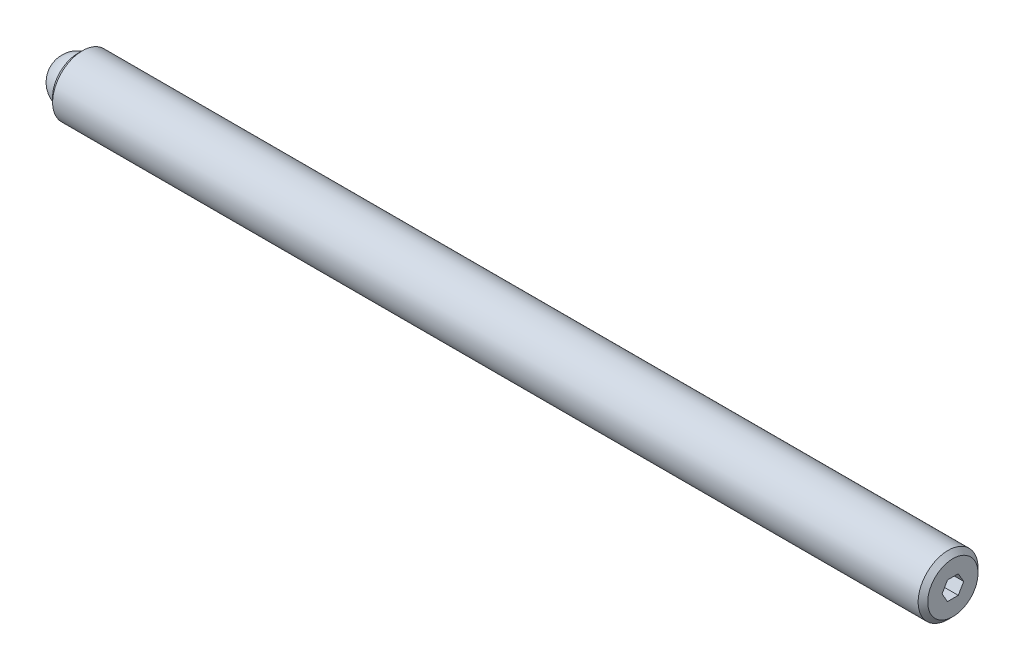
from build123d import *

# Parameters (mm, degrees)
SKETCH2_R           = 3.175
BOSS_EXTRUDE1_DEPTH = 92.86875
CHAMFER1_SIZE       = 0.508
CHAMFER2_SIZE       = 0.508
CUT_EXTRUDE2_DEPTH  = 2.286
SKETCH3_R           = 2.38125
CUT_EXTRUDE3_DEPTH  = 1.984375


with BuildPart() as part:
    # Sketch2 → Boss-Extrude1 (new body)
    with BuildSketch(Plane(origin=(0, 0, 0), x_dir=(0, 0, -1), z_dir=(1, 0, 0))):
        Circle(SKETCH2_R)
    extrude(amount=BOSS_EXTRUDE1_DEPTH)

    # Chamfer1
    chamfer1_edges = [part.edges().sort_by_distance(p)[0] for p in [
        (0, 0, 3.175),
    ]]
    chamfer(chamfer1_edges, length=CHAMFER1_SIZE)

    # Chamfer2
    chamfer2_edges = [part.edges().sort_by_distance(p)[0] for p in [
        (92.86875, 0, 3.175),
    ]]
    chamfer(chamfer2_edges, length=CHAMFER2_SIZE)

    # Sketch4 → Cut-Extrude2 (cut)
    with BuildSketch(Plane(origin=(92.86875, 0, 0), x_dir=(0, 0, -1), z_dir=(1, 0, 0))):
        Polygon((1.14567944, 0), (0.57283972, 0.9921875), (-0.57283972, 0.9921875), (-1.14567944, 0), (-0.57283972, -0.9921875), (0.57283972, -0.9921875), align=None)
    extrude(amount=-CUT_EXTRUDE2_DEPTH, mode=Mode.SUBTRACT)

    # Sketch3 → Cut-Extrude3 (cut)
    with BuildSketch(Plane.ZY):
        Circle(SKETCH3_R)
    extrude(amount=-CUT_EXTRUDE3_DEPTH, mode=Mode.SUBTRACT)


with BuildPart() as body_2:
    # Sketch5 → Revolve1 (revolve)
    with BuildSketch(Plane.ZY):
        with BuildLine():
            Line((0, 0), (0, -2.38125))
            ThreePointArc((0, -2.38125), (-2.38125, 0), (0, 2.38125))
            Line((0, 2.38125), (0, 0))
        make_face()
    revolve(axis=Axis((0, 0, 0), (0, 1, 0)))


solid = Compound([part.part, body_2.part])
